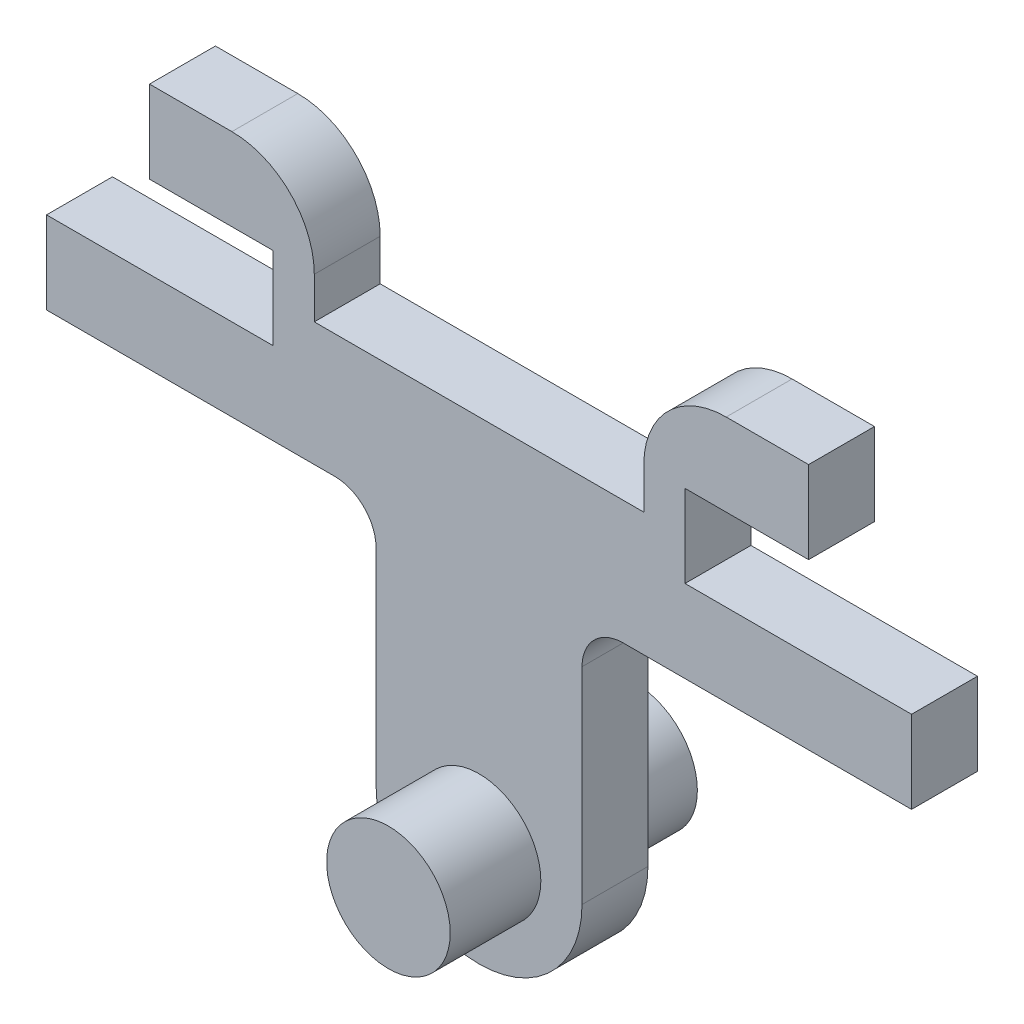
ISO-10303-21;
HEADER;
FILE_DESCRIPTION(('STEP AP214'),'2;1');
FILE_NAME('part.step','',(''),(''),'','','');
FILE_SCHEMA(('AUTOMOTIVE_DESIGN { 1 0 10303 214 1 1 1 1 }'));
ENDSEC;
DATA;
#1=APPLICATION_CONTEXT('core data for automotive mechanical design processes');
#2=APPLICATION_PROTOCOL_DEFINITION('international standard','automotive_design',2000,#1);
#3=PRODUCT_CONTEXT('',#1,'mechanical');
#4=PRODUCT('Part','Part','',(#3));
#5=PRODUCT_RELATED_PRODUCT_CATEGORY('part','',(#4));
#6=PRODUCT_DEFINITION_FORMATION('','',#4);
#7=PRODUCT_DEFINITION_CONTEXT('part definition',#1,'design');
#8=PRODUCT_DEFINITION('design','',#6,#7);
#9=PRODUCT_DEFINITION_SHAPE('','',#8);
#10=(LENGTH_UNIT() NAMED_UNIT(*) SI_UNIT(.MILLI.,.METRE.));
#11=(NAMED_UNIT(*) PLANE_ANGLE_UNIT() SI_UNIT($,.RADIAN.));
#12=(NAMED_UNIT(*) SI_UNIT($,.STERADIAN.) SOLID_ANGLE_UNIT());
#13=UNCERTAINTY_MEASURE_WITH_UNIT(LENGTH_MEASURE(1.E-05),#10,'distance_accuracy_value','');
#14=(GEOMETRIC_REPRESENTATION_CONTEXT(3) GLOBAL_UNCERTAINTY_ASSIGNED_CONTEXT((#13)) GLOBAL_UNIT_ASSIGNED_CONTEXT((#10,
#11,#12)) REPRESENTATION_CONTEXT('',''));
#15=CARTESIAN_POINT('',(0.,0.,0.));
#16=DIRECTION('',(0.,0.,1.));
#17=DIRECTION('',(1.,0.,0.));
#18=AXIS2_PLACEMENT_3D('',#15,#16,#17);
#19=CARTESIAN_POINT('',(0.,0.,-15.));
#20=DIRECTION('',(0.,0.,1.));
#21=DIRECTION('',(1.,0.,0.));
#22=AXIS2_PLACEMENT_3D('',#19,#20,#21);
#23=CYLINDRICAL_SURFACE('',#22,7.5);
#24=CARTESIAN_POINT('',(0.,0.,4.));
#25=DIRECTION('',(0.,0.,1.));
#26=DIRECTION('',(1.,0.,0.));
#27=AXIS2_PLACEMENT_3D('',#24,#25,#26);
#28=CIRCLE('',#27,7.5);
#29=CARTESIAN_POINT('',(7.5,0.,4.));
#30=VERTEX_POINT('',#29);
#31=EDGE_CURVE('E11',#30,#30,#28,.F.);
#32=ORIENTED_EDGE('',*,*,#31,.F.);
#33=EDGE_LOOP('',(#32));
#34=FACE_BOUND('',#33,.T.);
#35=CARTESIAN_POINT('',(0.,0.,15.));
#36=DIRECTION('',(0.,0.,1.));
#37=DIRECTION('',(1.,0.,0.));
#38=AXIS2_PLACEMENT_3D('',#35,#36,#37);
#39=CIRCLE('',#38,7.5);
#40=CARTESIAN_POINT('',(7.5,0.,15.));
#41=VERTEX_POINT('',#40);
#42=EDGE_CURVE('E389',#41,#41,#39,.T.);
#43=ORIENTED_EDGE('',*,*,#42,.F.);
#44=EDGE_LOOP('',(#43));
#45=FACE_BOUND('',#44,.T.);
#46=ADVANCED_FACE('F33',(#34,#45),#23,.T.);
#47=CARTESIAN_POINT('',(0.,0.,15.));
#48=DIRECTION('',(0.,0.,1.));
#49=DIRECTION('',(1.,0.,0.));
#50=AXIS2_PLACEMENT_3D('',#47,#48,#49);
#51=PLANE('',#50);
#52=ORIENTED_EDGE('',*,*,#42,.T.);
#53=EDGE_LOOP('',(#52));
#54=FACE_BOUND('',#53,.T.);
#55=ADVANCED_FACE('F410',(#54),#51,.T.);
#56=CARTESIAN_POINT('',(-30.,50.,4.));
#57=DIRECTION('',(0.,0.,-1.));
#58=DIRECTION('',(-1.,0.,0.));
#59=AXIS2_PLACEMENT_3D('',#56,#57,#58);
#60=CYLINDRICAL_SURFACE('',#59,10.);
#61=CARTESIAN_POINT('',(-30.,50.,-4.));
#62=DIRECTION('',(0.,0.,-1.));
#63=DIRECTION('',(1.,0.,0.));
#64=AXIS2_PLACEMENT_3D('',#61,#62,#63);
#65=CIRCLE('',#64,10.);
#66=CARTESIAN_POINT('',(-30.,60.,-4.));
#67=VERTEX_POINT('',#66);
#68=CARTESIAN_POINT('',(-20.,50.,-4.));
#69=VERTEX_POINT('',#68);
#70=EDGE_CURVE('E196',#67,#69,#65,.T.);
#71=ORIENTED_EDGE('',*,*,#70,.F.);
#72=DIRECTION('',(0.,0.,-1.));
#73=VECTOR('',#72,1.);
#74=CARTESIAN_POINT('',(-30.,60.,4.));
#75=LINE('',#74,#73);
#76=CARTESIAN_POINT('',(-30.,60.,4.));
#77=VERTEX_POINT('',#76);
#78=EDGE_CURVE('E47',#77,#67,#75,.T.);
#79=ORIENTED_EDGE('',*,*,#78,.F.);
#80=CARTESIAN_POINT('',(-30.,50.,4.));
#81=DIRECTION('',(0.,0.,-1.));
#82=DIRECTION('',(1.,0.,0.));
#83=AXIS2_PLACEMENT_3D('',#80,#81,#82);
#84=CIRCLE('',#83,10.);
#85=CARTESIAN_POINT('',(-20.,50.,4.));
#86=VERTEX_POINT('',#85);
#87=EDGE_CURVE('E198',#77,#86,#84,.T.);
#88=ORIENTED_EDGE('',*,*,#87,.T.);
#89=DIRECTION('',(0.,0.,-1.));
#90=VECTOR('',#89,1.);
#91=CARTESIAN_POINT('',(-20.,50.,4.));
#92=LINE('',#91,#90);
#93=EDGE_CURVE('E192',#86,#69,#92,.T.);
#94=ORIENTED_EDGE('',*,*,#93,.T.);
#95=EDGE_LOOP('',(#71,#79,#88,#94));
#96=FACE_BOUND('',#95,.T.);
#97=ADVANCED_FACE('F194',(#96),#60,.T.);
#98=CARTESIAN_POINT('',(-40.,60.,4.));
#99=DIRECTION('',(0.,1.,0.));
#100=DIRECTION('',(-1.,0.,0.));
#101=AXIS2_PLACEMENT_3D('',#98,#99,#100);
#102=PLANE('',#101);
#103=DIRECTION('',(1.,0.,0.));
#104=VECTOR('',#103,1.);
#105=CARTESIAN_POINT('',(-40.,60.,-4.));
#106=LINE('',#105,#104);
#107=CARTESIAN_POINT('',(-40.,60.,-4.));
#108=VERTEX_POINT('',#107);
#109=EDGE_CURVE('E215',#108,#67,#106,.T.);
#110=ORIENTED_EDGE('',*,*,#109,.F.);
#111=DIRECTION('',(0.,0.,-1.));
#112=VECTOR('',#111,1.);
#113=CARTESIAN_POINT('',(-40.,60.,4.));
#114=LINE('',#113,#112);
#115=CARTESIAN_POINT('',(-40.,60.,4.));
#116=VERTEX_POINT('',#115);
#117=EDGE_CURVE('E55',#116,#108,#114,.T.);
#118=ORIENTED_EDGE('',*,*,#117,.F.);
#119=DIRECTION('',(1.,0.,0.));
#120=VECTOR('',#119,1.);
#121=CARTESIAN_POINT('',(-40.,60.,4.));
#122=LINE('',#121,#120);
#123=EDGE_CURVE('E203',#116,#77,#122,.T.);
#124=ORIENTED_EDGE('',*,*,#123,.T.);
#125=ORIENTED_EDGE('',*,*,#78,.T.);
#126=EDGE_LOOP('',(#110,#118,#124,#125));
#127=FACE_BOUND('',#126,.T.);
#128=ADVANCED_FACE('F447',(#127),#102,.T.);
#129=CARTESIAN_POINT('',(-40.,50.,4.));
#130=DIRECTION('',(-1.,0.,0.));
#131=DIRECTION('',(0.,0.,1.));
#132=AXIS2_PLACEMENT_3D('',#129,#130,#131);
#133=PLANE('',#132);
#134=DIRECTION('',(0.,1.,0.));
#135=VECTOR('',#134,1.);
#136=CARTESIAN_POINT('',(-40.,50.,-4.));
#137=LINE('',#136,#135);
#138=CARTESIAN_POINT('',(-40.,50.,-4.));
#139=VERTEX_POINT('',#138);
#140=EDGE_CURVE('E276',#139,#108,#137,.T.);
#141=ORIENTED_EDGE('',*,*,#140,.F.);
#142=DIRECTION('',(0.,0.,-1.));
#143=VECTOR('',#142,1.);
#144=CARTESIAN_POINT('',(-40.,50.,4.));
#145=LINE('',#144,#143);
#146=CARTESIAN_POINT('',(-40.,50.,4.));
#147=VERTEX_POINT('',#146);
#148=EDGE_CURVE('E348',#147,#139,#145,.T.);
#149=ORIENTED_EDGE('',*,*,#148,.F.);
#150=DIRECTION('',(0.,1.,0.));
#151=VECTOR('',#150,1.);
#152=CARTESIAN_POINT('',(-40.,50.,4.));
#153=LINE('',#152,#151);
#154=EDGE_CURVE('E342',#147,#116,#153,.T.);
#155=ORIENTED_EDGE('',*,*,#154,.T.);
#156=ORIENTED_EDGE('',*,*,#117,.T.);
#157=EDGE_LOOP('',(#141,#149,#155,#156));
#158=FACE_BOUND('',#157,.T.);
#159=ADVANCED_FACE('F456',(#158),#133,.T.);
#160=CARTESIAN_POINT('',(-25.,50.,4.));
#161=DIRECTION('',(0.,-1.,0.));
#162=DIRECTION('',(1.,0.,0.));
#163=AXIS2_PLACEMENT_3D('',#160,#161,#162);
#164=PLANE('',#163);
#165=DIRECTION('',(-1.,0.,0.));
#166=VECTOR('',#165,1.);
#167=CARTESIAN_POINT('',(-25.,50.,-4.));
#168=LINE('',#167,#166);
#169=CARTESIAN_POINT('',(-25.,50.,-4.));
#170=VERTEX_POINT('',#169);
#171=EDGE_CURVE('E273',#170,#139,#168,.T.);
#172=ORIENTED_EDGE('',*,*,#171,.F.);
#173=DIRECTION('',(0.,0.,-1.));
#174=VECTOR('',#173,1.);
#175=CARTESIAN_POINT('',(-25.,50.,4.));
#176=LINE('',#175,#174);
#177=CARTESIAN_POINT('',(-25.,50.,4.));
#178=VERTEX_POINT('',#177);
#179=EDGE_CURVE('E350',#178,#170,#176,.T.);
#180=ORIENTED_EDGE('',*,*,#179,.F.);
#181=DIRECTION('',(-1.,0.,0.));
#182=VECTOR('',#181,1.);
#183=CARTESIAN_POINT('',(-25.,50.,4.));
#184=LINE('',#183,#182);
#185=EDGE_CURVE('E339',#178,#147,#184,.T.);
#186=ORIENTED_EDGE('',*,*,#185,.T.);
#187=ORIENTED_EDGE('',*,*,#148,.T.);
#188=EDGE_LOOP('',(#172,#180,#186,#187));
#189=FACE_BOUND('',#188,.T.);
#190=ADVANCED_FACE('F465',(#189),#164,.T.);
#191=CARTESIAN_POINT('',(-25.,40.,4.));
#192=DIRECTION('',(-1.,0.,0.));
#193=DIRECTION('',(0.,0.,1.));
#194=AXIS2_PLACEMENT_3D('',#191,#192,#193);
#195=PLANE('',#194);
#196=DIRECTION('',(0.,1.,0.));
#197=VECTOR('',#196,1.);
#198=CARTESIAN_POINT('',(-25.,40.,-4.));
#199=LINE('',#198,#197);
#200=CARTESIAN_POINT('',(-25.,40.,-4.));
#201=VERTEX_POINT('',#200);
#202=EDGE_CURVE('E270',#201,#170,#199,.T.);
#203=ORIENTED_EDGE('',*,*,#202,.F.);
#204=DIRECTION('',(0.,0.,-1.));
#205=VECTOR('',#204,1.);
#206=CARTESIAN_POINT('',(-25.,40.,4.));
#207=LINE('',#206,#205);
#208=CARTESIAN_POINT('',(-25.,40.,4.));
#209=VERTEX_POINT('',#208);
#210=EDGE_CURVE('E352',#209,#201,#207,.T.);
#211=ORIENTED_EDGE('',*,*,#210,.F.);
#212=DIRECTION('',(0.,1.,0.));
#213=VECTOR('',#212,1.);
#214=CARTESIAN_POINT('',(-25.,40.,4.));
#215=LINE('',#214,#213);
#216=EDGE_CURVE('E336',#209,#178,#215,.T.);
#217=ORIENTED_EDGE('',*,*,#216,.T.);
#218=ORIENTED_EDGE('',*,*,#179,.T.);
#219=EDGE_LOOP('',(#203,#211,#217,#218));
#220=FACE_BOUND('',#219,.T.);
#221=ADVANCED_FACE('F475',(#220),#195,.T.);
#222=CARTESIAN_POINT('',(-52.5,40.,4.));
#223=DIRECTION('',(0.,1.,0.));
#224=DIRECTION('',(0.,0.,1.));
#225=AXIS2_PLACEMENT_3D('',#222,#223,#224);
#226=PLANE('',#225);
#227=DIRECTION('',(1.,0.,0.));
#228=VECTOR('',#227,1.);
#229=CARTESIAN_POINT('',(-52.5,40.,-4.));
#230=LINE('',#229,#228);
#231=CARTESIAN_POINT('',(-52.5,40.,-4.));
#232=VERTEX_POINT('',#231);
#233=EDGE_CURVE('E267',#232,#201,#230,.T.);
#234=ORIENTED_EDGE('',*,*,#233,.F.);
#235=DIRECTION('',(0.,0.,-1.));
#236=VECTOR('',#235,1.);
#237=CARTESIAN_POINT('',(-52.5,40.,4.));
#238=LINE('',#237,#236);
#239=CARTESIAN_POINT('',(-52.5,40.,4.));
#240=VERTEX_POINT('',#239);
#241=EDGE_CURVE('E354',#240,#232,#238,.T.);
#242=ORIENTED_EDGE('',*,*,#241,.F.);
#243=DIRECTION('',(1.,0.,0.));
#244=VECTOR('',#243,1.);
#245=CARTESIAN_POINT('',(-52.5,40.,4.));
#246=LINE('',#245,#244);
#247=EDGE_CURVE('E333',#240,#209,#246,.T.);
#248=ORIENTED_EDGE('',*,*,#247,.T.);
#249=ORIENTED_EDGE('',*,*,#210,.T.);
#250=EDGE_LOOP('',(#234,#242,#248,#249));
#251=FACE_BOUND('',#250,.T.);
#252=ADVANCED_FACE('F485',(#251),#226,.T.);
#253=CARTESIAN_POINT('',(-52.5,30.,4.));
#254=DIRECTION('',(-1.,0.,0.));
#255=DIRECTION('',(0.,-1.,0.));
#256=AXIS2_PLACEMENT_3D('',#253,#254,#255);
#257=PLANE('',#256);
#258=DIRECTION('',(0.,1.,0.));
#259=VECTOR('',#258,1.);
#260=CARTESIAN_POINT('',(-52.5,30.,-4.));
#261=LINE('',#260,#259);
#262=CARTESIAN_POINT('',(-52.5,30.,-4.));
#263=VERTEX_POINT('',#262);
#264=EDGE_CURVE('E264',#263,#232,#261,.T.);
#265=ORIENTED_EDGE('',*,*,#264,.F.);
#266=DIRECTION('',(0.,0.,-1.));
#267=VECTOR('',#266,1.);
#268=CARTESIAN_POINT('',(-52.5,30.,4.));
#269=LINE('',#268,#267);
#270=CARTESIAN_POINT('',(-52.5,30.,4.));
#271=VERTEX_POINT('',#270);
#272=EDGE_CURVE('E356',#271,#263,#269,.T.);
#273=ORIENTED_EDGE('',*,*,#272,.F.);
#274=DIRECTION('',(0.,1.,0.));
#275=VECTOR('',#274,1.);
#276=CARTESIAN_POINT('',(-52.5,30.,4.));
#277=LINE('',#276,#275);
#278=EDGE_CURVE('E330',#271,#240,#277,.T.);
#279=ORIENTED_EDGE('',*,*,#278,.T.);
#280=ORIENTED_EDGE('',*,*,#241,.T.);
#281=EDGE_LOOP('',(#265,#273,#279,#280));
#282=FACE_BOUND('',#281,.T.);
#283=ADVANCED_FACE('F495',(#282),#257,.T.);
#284=CARTESIAN_POINT('',(-17.5,30.,4.));
#285=DIRECTION('',(0.,-1.,0.));
#286=DIRECTION('',(0.,0.,-1.));
#287=AXIS2_PLACEMENT_3D('',#284,#285,#286);
#288=PLANE('',#287);
#289=DIRECTION('',(-1.,0.,0.));
#290=VECTOR('',#289,1.);
#291=CARTESIAN_POINT('',(-17.5,30.,-4.));
#292=LINE('',#291,#290);
#293=CARTESIAN_POINT('',(-17.5,30.,-4.));
#294=VERTEX_POINT('',#293);
#295=EDGE_CURVE('E261',#294,#263,#292,.T.);
#296=ORIENTED_EDGE('',*,*,#295,.F.);
#297=DIRECTION('',(0.,0.,-1.));
#298=VECTOR('',#297,1.);
#299=CARTESIAN_POINT('',(-17.5,30.,4.));
#300=LINE('',#299,#298);
#301=CARTESIAN_POINT('',(-17.5,30.,4.));
#302=VERTEX_POINT('',#301);
#303=EDGE_CURVE('E358',#302,#294,#300,.T.);
#304=ORIENTED_EDGE('',*,*,#303,.F.);
#305=DIRECTION('',(-1.,0.,0.));
#306=VECTOR('',#305,1.);
#307=CARTESIAN_POINT('',(-17.5,30.,4.));
#308=LINE('',#307,#306);
#309=EDGE_CURVE('E327',#302,#271,#308,.T.);
#310=ORIENTED_EDGE('',*,*,#309,.T.);
#311=ORIENTED_EDGE('',*,*,#272,.T.);
#312=EDGE_LOOP('',(#296,#304,#310,#311));
#313=FACE_BOUND('',#312,.T.);
#314=ADVANCED_FACE('F505',(#313),#288,.T.);
#315=CARTESIAN_POINT('',(-17.5,25.,4.));
#316=DIRECTION('',(0.,0.,-1.));
#317=DIRECTION('',(-1.,0.,0.));
#318=AXIS2_PLACEMENT_3D('',#315,#316,#317);
#319=CYLINDRICAL_SURFACE('',#318,5.);
#320=CARTESIAN_POINT('',(-17.5,25.,-4.));
#321=DIRECTION('',(0.,0.,1.));
#322=DIRECTION('',(-1.,0.,0.));
#323=AXIS2_PLACEMENT_3D('',#320,#321,#322);
#324=CIRCLE('',#323,5.);
#325=CARTESIAN_POINT('',(-12.5,25.,-4.));
#326=VERTEX_POINT('',#325);
#327=EDGE_CURVE('E258',#326,#294,#324,.T.);
#328=ORIENTED_EDGE('',*,*,#327,.F.);
#329=DIRECTION('',(0.,0.,-1.));
#330=VECTOR('',#329,1.);
#331=CARTESIAN_POINT('',(-12.5,25.,4.));
#332=LINE('',#331,#330);
#333=CARTESIAN_POINT('',(-12.5,25.,4.));
#334=VERTEX_POINT('',#333);
#335=EDGE_CURVE('E360',#334,#326,#332,.T.);
#336=ORIENTED_EDGE('',*,*,#335,.F.);
#337=CARTESIAN_POINT('',(-17.5,25.,4.));
#338=DIRECTION('',(0.,0.,1.));
#339=DIRECTION('',(-1.,0.,0.));
#340=AXIS2_PLACEMENT_3D('',#337,#338,#339);
#341=CIRCLE('',#340,5.);
#342=EDGE_CURVE('E324',#334,#302,#341,.T.);
#343=ORIENTED_EDGE('',*,*,#342,.T.);
#344=ORIENTED_EDGE('',*,*,#303,.T.);
#345=EDGE_LOOP('',(#328,#336,#343,#344));
#346=FACE_BOUND('',#345,.T.);
#347=ADVANCED_FACE('F515',(#346),#319,.F.);
#348=CARTESIAN_POINT('',(-12.5,0.,4.));
#349=DIRECTION('',(-1.,0.,0.));
#350=DIRECTION('',(0.,0.,1.));
#351=AXIS2_PLACEMENT_3D('',#348,#349,#350);
#352=PLANE('',#351);
#353=DIRECTION('',(0.,1.,0.));
#354=VECTOR('',#353,1.);
#355=CARTESIAN_POINT('',(-12.5,0.,-4.));
#356=LINE('',#355,#354);
#357=CARTESIAN_POINT('',(-12.5,0.,-4.));
#358=VERTEX_POINT('',#357);
#359=EDGE_CURVE('E255',#358,#326,#356,.T.);
#360=ORIENTED_EDGE('',*,*,#359,.F.);
#361=DIRECTION('',(0.,0.,-1.));
#362=VECTOR('',#361,1.);
#363=CARTESIAN_POINT('',(-12.5,0.,4.));
#364=LINE('',#363,#362);
#365=CARTESIAN_POINT('',(-12.5,0.,4.));
#366=VERTEX_POINT('',#365);
#367=EDGE_CURVE('E362',#366,#358,#364,.T.);
#368=ORIENTED_EDGE('',*,*,#367,.F.);
#369=DIRECTION('',(0.,1.,0.));
#370=VECTOR('',#369,1.);
#371=CARTESIAN_POINT('',(-12.5,0.,4.));
#372=LINE('',#371,#370);
#373=EDGE_CURVE('E321',#366,#334,#372,.T.);
#374=ORIENTED_EDGE('',*,*,#373,.T.);
#375=ORIENTED_EDGE('',*,*,#335,.T.);
#376=EDGE_LOOP('',(#360,#368,#374,#375));
#377=FACE_BOUND('',#376,.T.);
#378=ADVANCED_FACE('F525',(#377),#352,.T.);
#379=CARTESIAN_POINT('',(0.,0.,4.));
#380=DIRECTION('',(0.,0.,-1.));
#381=DIRECTION('',(-1.,0.,0.));
#382=AXIS2_PLACEMENT_3D('',#379,#380,#381);
#383=CYLINDRICAL_SURFACE('',#382,12.5);
#384=CARTESIAN_POINT('',(0.,0.,-4.));
#385=DIRECTION('',(0.,0.,-1.));
#386=DIRECTION('',(-1.,0.,0.));
#387=AXIS2_PLACEMENT_3D('',#384,#385,#386);
#388=CIRCLE('',#387,12.5);
#389=CARTESIAN_POINT('',(12.5,0.,-4.));
#390=VERTEX_POINT('',#389);
#391=EDGE_CURVE('E252',#390,#358,#388,.T.);
#392=ORIENTED_EDGE('',*,*,#391,.F.);
#393=DIRECTION('',(0.,0.,-1.));
#394=VECTOR('',#393,1.);
#395=CARTESIAN_POINT('',(12.5,0.,4.));
#396=LINE('',#395,#394);
#397=CARTESIAN_POINT('',(12.5,0.,4.));
#398=VERTEX_POINT('',#397);
#399=EDGE_CURVE('E364',#398,#390,#396,.T.);
#400=ORIENTED_EDGE('',*,*,#399,.F.);
#401=CARTESIAN_POINT('',(0.,0.,4.));
#402=DIRECTION('',(0.,0.,-1.));
#403=DIRECTION('',(-1.,0.,0.));
#404=AXIS2_PLACEMENT_3D('',#401,#402,#403);
#405=CIRCLE('',#404,12.5);
#406=EDGE_CURVE('E318',#398,#366,#405,.T.);
#407=ORIENTED_EDGE('',*,*,#406,.T.);
#408=ORIENTED_EDGE('',*,*,#367,.T.);
#409=EDGE_LOOP('',(#392,#400,#407,#408));
#410=FACE_BOUND('',#409,.T.);
#411=ADVANCED_FACE('F535',(#410),#383,.T.);
#412=CARTESIAN_POINT('',(12.5,0.,4.));
#413=DIRECTION('',(1.,0.,0.));
#414=DIRECTION('',(0.,0.,-1.));
#415=AXIS2_PLACEMENT_3D('',#412,#413,#414);
#416=PLANE('',#415);
#417=DIRECTION('',(0.,-1.,0.));
#418=VECTOR('',#417,1.);
#419=CARTESIAN_POINT('',(12.5,0.,-4.));
#420=LINE('',#419,#418);
#421=CARTESIAN_POINT('',(12.5,25.,-4.));
#422=VERTEX_POINT('',#421);
#423=EDGE_CURVE('E249',#422,#390,#420,.T.);
#424=ORIENTED_EDGE('',*,*,#423,.F.);
#425=DIRECTION('',(0.,0.,-1.));
#426=VECTOR('',#425,1.);
#427=CARTESIAN_POINT('',(12.5,25.,4.));
#428=LINE('',#427,#426);
#429=CARTESIAN_POINT('',(12.5,25.,4.));
#430=VERTEX_POINT('',#429);
#431=EDGE_CURVE('E366',#430,#422,#428,.T.);
#432=ORIENTED_EDGE('',*,*,#431,.F.);
#433=DIRECTION('',(0.,-1.,0.));
#434=VECTOR('',#433,1.);
#435=CARTESIAN_POINT('',(12.5,0.,4.));
#436=LINE('',#435,#434);
#437=EDGE_CURVE('E315',#430,#398,#436,.T.);
#438=ORIENTED_EDGE('',*,*,#437,.T.);
#439=ORIENTED_EDGE('',*,*,#399,.T.);
#440=EDGE_LOOP('',(#424,#432,#438,#439));
#441=FACE_BOUND('',#440,.T.);
#442=ADVANCED_FACE('F545',(#441),#416,.T.);
#443=CARTESIAN_POINT('',(17.5,25.,4.));
#444=DIRECTION('',(0.,0.,-1.));
#445=DIRECTION('',(-1.,0.,0.));
#446=AXIS2_PLACEMENT_3D('',#443,#444,#445);
#447=CYLINDRICAL_SURFACE('',#446,5.);
#448=CARTESIAN_POINT('',(17.5,25.,-4.));
#449=DIRECTION('',(0.,0.,1.));
#450=DIRECTION('',(-1.,0.,0.));
#451=AXIS2_PLACEMENT_3D('',#448,#449,#450);
#452=CIRCLE('',#451,5.);
#453=CARTESIAN_POINT('',(17.5,30.,-4.));
#454=VERTEX_POINT('',#453);
#455=EDGE_CURVE('E246',#454,#422,#452,.T.);
#456=ORIENTED_EDGE('',*,*,#455,.F.);
#457=DIRECTION('',(0.,0.,-1.));
#458=VECTOR('',#457,1.);
#459=CARTESIAN_POINT('',(17.5,30.,4.));
#460=LINE('',#459,#458);
#461=CARTESIAN_POINT('',(17.5,30.,4.));
#462=VERTEX_POINT('',#461);
#463=EDGE_CURVE('E368',#462,#454,#460,.T.);
#464=ORIENTED_EDGE('',*,*,#463,.F.);
#465=CARTESIAN_POINT('',(17.5,25.,4.));
#466=DIRECTION('',(0.,0.,1.));
#467=DIRECTION('',(-1.,0.,0.));
#468=AXIS2_PLACEMENT_3D('',#465,#466,#467);
#469=CIRCLE('',#468,5.);
#470=EDGE_CURVE('E312',#462,#430,#469,.T.);
#471=ORIENTED_EDGE('',*,*,#470,.T.);
#472=ORIENTED_EDGE('',*,*,#431,.T.);
#473=EDGE_LOOP('',(#456,#464,#471,#472));
#474=FACE_BOUND('',#473,.T.);
#475=ADVANCED_FACE('F555',(#474),#447,.F.);
#476=CARTESIAN_POINT('',(17.5,30.,4.));
#477=DIRECTION('',(0.,-1.,0.));
#478=DIRECTION('',(0.,0.,-1.));
#479=AXIS2_PLACEMENT_3D('',#476,#477,#478);
#480=PLANE('',#479);
#481=DIRECTION('',(-1.,0.,0.));
#482=VECTOR('',#481,1.);
#483=CARTESIAN_POINT('',(17.5,30.,-4.));
#484=LINE('',#483,#482);
#485=CARTESIAN_POINT('',(52.5,30.,-4.));
#486=VERTEX_POINT('',#485);
#487=EDGE_CURVE('E243',#486,#454,#484,.T.);
#488=ORIENTED_EDGE('',*,*,#487,.F.);
#489=DIRECTION('',(0.,0.,-1.));
#490=VECTOR('',#489,1.);
#491=CARTESIAN_POINT('',(52.5,30.,4.));
#492=LINE('',#491,#490);
#493=CARTESIAN_POINT('',(52.5,30.,4.));
#494=VERTEX_POINT('',#493);
#495=EDGE_CURVE('E370',#494,#486,#492,.T.);
#496=ORIENTED_EDGE('',*,*,#495,.F.);
#497=DIRECTION('',(-1.,0.,0.));
#498=VECTOR('',#497,1.);
#499=CARTESIAN_POINT('',(17.5,30.,4.));
#500=LINE('',#499,#498);
#501=EDGE_CURVE('E309',#494,#462,#500,.T.);
#502=ORIENTED_EDGE('',*,*,#501,.T.);
#503=ORIENTED_EDGE('',*,*,#463,.T.);
#504=EDGE_LOOP('',(#488,#496,#502,#503));
#505=FACE_BOUND('',#504,.T.);
#506=ADVANCED_FACE('F565',(#505),#480,.T.);
#507=CARTESIAN_POINT('',(52.5,30.,4.));
#508=DIRECTION('',(1.,0.,0.));
#509=DIRECTION('',(0.,1.,0.));
#510=AXIS2_PLACEMENT_3D('',#507,#508,#509);
#511=PLANE('',#510);
#512=DIRECTION('',(0.,-1.,0.));
#513=VECTOR('',#512,1.);
#514=CARTESIAN_POINT('',(52.5,30.,-4.));
#515=LINE('',#514,#513);
#516=CARTESIAN_POINT('',(52.5,40.,-4.));
#517=VERTEX_POINT('',#516);
#518=EDGE_CURVE('E240',#517,#486,#515,.T.);
#519=ORIENTED_EDGE('',*,*,#518,.F.);
#520=DIRECTION('',(0.,0.,-1.));
#521=VECTOR('',#520,1.);
#522=CARTESIAN_POINT('',(52.5,40.,4.));
#523=LINE('',#522,#521);
#524=CARTESIAN_POINT('',(52.5,40.,4.));
#525=VERTEX_POINT('',#524);
#526=EDGE_CURVE('E372',#525,#517,#523,.T.);
#527=ORIENTED_EDGE('',*,*,#526,.F.);
#528=DIRECTION('',(0.,-1.,0.));
#529=VECTOR('',#528,1.);
#530=CARTESIAN_POINT('',(52.5,30.,4.));
#531=LINE('',#530,#529);
#532=EDGE_CURVE('E306',#525,#494,#531,.T.);
#533=ORIENTED_EDGE('',*,*,#532,.T.);
#534=ORIENTED_EDGE('',*,*,#495,.T.);
#535=EDGE_LOOP('',(#519,#527,#533,#534));
#536=FACE_BOUND('',#535,.T.);
#537=ADVANCED_FACE('F575',(#536),#511,.T.);
#538=CARTESIAN_POINT('',(52.5,40.,4.));
#539=DIRECTION('',(0.,1.,0.));
#540=DIRECTION('',(-1.,0.,0.));
#541=AXIS2_PLACEMENT_3D('',#538,#539,#540);
#542=PLANE('',#541);
#543=DIRECTION('',(1.,0.,0.));
#544=VECTOR('',#543,1.);
#545=CARTESIAN_POINT('',(52.5,40.,-4.));
#546=LINE('',#545,#544);
#547=CARTESIAN_POINT('',(25.,40.,-4.));
#548=VERTEX_POINT('',#547);
#549=EDGE_CURVE('E237',#548,#517,#546,.T.);
#550=ORIENTED_EDGE('',*,*,#549,.F.);
#551=DIRECTION('',(0.,0.,-1.));
#552=VECTOR('',#551,1.);
#553=CARTESIAN_POINT('',(25.,40.,4.));
#554=LINE('',#553,#552);
#555=CARTESIAN_POINT('',(25.,40.,4.));
#556=VERTEX_POINT('',#555);
#557=EDGE_CURVE('E374',#556,#548,#554,.T.);
#558=ORIENTED_EDGE('',*,*,#557,.F.);
#559=DIRECTION('',(1.,0.,0.));
#560=VECTOR('',#559,1.);
#561=CARTESIAN_POINT('',(52.5,40.,4.));
#562=LINE('',#561,#560);
#563=EDGE_CURVE('E303',#556,#525,#562,.T.);
#564=ORIENTED_EDGE('',*,*,#563,.T.);
#565=ORIENTED_EDGE('',*,*,#526,.T.);
#566=EDGE_LOOP('',(#550,#558,#564,#565));
#567=FACE_BOUND('',#566,.T.);
#568=ADVANCED_FACE('F585',(#567),#542,.T.);
#569=CARTESIAN_POINT('',(25.,40.,4.));
#570=DIRECTION('',(1.,0.,0.));
#571=DIRECTION('',(0.,0.,-1.));
#572=AXIS2_PLACEMENT_3D('',#569,#570,#571);
#573=PLANE('',#572);
#574=DIRECTION('',(0.,-1.,0.));
#575=VECTOR('',#574,1.);
#576=CARTESIAN_POINT('',(25.,40.,-4.));
#577=LINE('',#576,#575);
#578=CARTESIAN_POINT('',(25.,50.,-4.));
#579=VERTEX_POINT('',#578);
#580=EDGE_CURVE('E234',#579,#548,#577,.T.);
#581=ORIENTED_EDGE('',*,*,#580,.F.);
#582=DIRECTION('',(0.,0.,-1.));
#583=VECTOR('',#582,1.);
#584=CARTESIAN_POINT('',(25.,50.,4.));
#585=LINE('',#584,#583);
#586=CARTESIAN_POINT('',(25.,50.,4.));
#587=VERTEX_POINT('',#586);
#588=EDGE_CURVE('E376',#587,#579,#585,.T.);
#589=ORIENTED_EDGE('',*,*,#588,.F.);
#590=DIRECTION('',(0.,-1.,0.));
#591=VECTOR('',#590,1.);
#592=CARTESIAN_POINT('',(25.,40.,4.));
#593=LINE('',#592,#591);
#594=EDGE_CURVE('E300',#587,#556,#593,.T.);
#595=ORIENTED_EDGE('',*,*,#594,.T.);
#596=ORIENTED_EDGE('',*,*,#557,.T.);
#597=EDGE_LOOP('',(#581,#589,#595,#596));
#598=FACE_BOUND('',#597,.T.);
#599=ADVANCED_FACE('F595',(#598),#573,.T.);
#600=CARTESIAN_POINT('',(25.,50.,4.));
#601=DIRECTION('',(0.,-1.,0.));
#602=DIRECTION('',(1.,0.,0.));
#603=AXIS2_PLACEMENT_3D('',#600,#601,#602);
#604=PLANE('',#603);
#605=DIRECTION('',(-1.,0.,0.));
#606=VECTOR('',#605,1.);
#607=CARTESIAN_POINT('',(25.,50.,-4.));
#608=LINE('',#607,#606);
#609=CARTESIAN_POINT('',(40.,50.,-4.));
#610=VERTEX_POINT('',#609);
#611=EDGE_CURVE('E231',#610,#579,#608,.T.);
#612=ORIENTED_EDGE('',*,*,#611,.F.);
#613=DIRECTION('',(0.,0.,-1.));
#614=VECTOR('',#613,1.);
#615=CARTESIAN_POINT('',(40.,50.,4.));
#616=LINE('',#615,#614);
#617=CARTESIAN_POINT('',(40.,50.,4.));
#618=VERTEX_POINT('',#617);
#619=EDGE_CURVE('E378',#618,#610,#616,.T.);
#620=ORIENTED_EDGE('',*,*,#619,.F.);
#621=DIRECTION('',(-1.,0.,0.));
#622=VECTOR('',#621,1.);
#623=CARTESIAN_POINT('',(25.,50.,4.));
#624=LINE('',#623,#622);
#625=EDGE_CURVE('E297',#618,#587,#624,.T.);
#626=ORIENTED_EDGE('',*,*,#625,.T.);
#627=ORIENTED_EDGE('',*,*,#588,.T.);
#628=EDGE_LOOP('',(#612,#620,#626,#627));
#629=FACE_BOUND('',#628,.T.);
#630=ADVANCED_FACE('F605',(#629),#604,.T.);
#631=CARTESIAN_POINT('',(40.,50.,4.));
#632=DIRECTION('',(1.,0.,0.));
#633=DIRECTION('',(0.,0.,-1.));
#634=AXIS2_PLACEMENT_3D('',#631,#632,#633);
#635=PLANE('',#634);
#636=DIRECTION('',(0.,-1.,0.));
#637=VECTOR('',#636,1.);
#638=CARTESIAN_POINT('',(40.,50.,-4.));
#639=LINE('',#638,#637);
#640=CARTESIAN_POINT('',(40.,60.,-4.));
#641=VERTEX_POINT('',#640);
#642=EDGE_CURVE('E228',#641,#610,#639,.T.);
#643=ORIENTED_EDGE('',*,*,#642,.F.);
#644=DIRECTION('',(0.,0.,-1.));
#645=VECTOR('',#644,1.);
#646=CARTESIAN_POINT('',(40.,60.,4.));
#647=LINE('',#646,#645);
#648=CARTESIAN_POINT('',(40.,60.,4.));
#649=VERTEX_POINT('',#648);
#650=EDGE_CURVE('E380',#649,#641,#647,.T.);
#651=ORIENTED_EDGE('',*,*,#650,.F.);
#652=DIRECTION('',(0.,-1.,0.));
#653=VECTOR('',#652,1.);
#654=CARTESIAN_POINT('',(40.,50.,4.));
#655=LINE('',#654,#653);
#656=EDGE_CURVE('E294',#649,#618,#655,.T.);
#657=ORIENTED_EDGE('',*,*,#656,.T.);
#658=ORIENTED_EDGE('',*,*,#619,.T.);
#659=EDGE_LOOP('',(#643,#651,#657,#658));
#660=FACE_BOUND('',#659,.T.);
#661=ADVANCED_FACE('F615',(#660),#635,.T.);
#662=CARTESIAN_POINT('',(40.,60.,4.));
#663=DIRECTION('',(0.,1.,0.));
#664=DIRECTION('',(0.,0.,1.));
#665=AXIS2_PLACEMENT_3D('',#662,#663,#664);
#666=PLANE('',#665);
#667=DIRECTION('',(1.,0.,0.));
#668=VECTOR('',#667,1.);
#669=CARTESIAN_POINT('',(40.,60.,-4.));
#670=LINE('',#669,#668);
#671=CARTESIAN_POINT('',(30.,60.,-4.));
#672=VERTEX_POINT('',#671);
#673=EDGE_CURVE('E225',#672,#641,#670,.T.);
#674=ORIENTED_EDGE('',*,*,#673,.F.);
#675=DIRECTION('',(0.,0.,-1.));
#676=VECTOR('',#675,1.);
#677=CARTESIAN_POINT('',(30.,60.,4.));
#678=LINE('',#677,#676);
#679=CARTESIAN_POINT('',(30.,60.,4.));
#680=VERTEX_POINT('',#679);
#681=EDGE_CURVE('E382',#680,#672,#678,.T.);
#682=ORIENTED_EDGE('',*,*,#681,.F.);
#683=DIRECTION('',(1.,0.,0.));
#684=VECTOR('',#683,1.);
#685=CARTESIAN_POINT('',(40.,60.,4.));
#686=LINE('',#685,#684);
#687=EDGE_CURVE('E291',#680,#649,#686,.T.);
#688=ORIENTED_EDGE('',*,*,#687,.T.);
#689=ORIENTED_EDGE('',*,*,#650,.T.);
#690=EDGE_LOOP('',(#674,#682,#688,#689));
#691=FACE_BOUND('',#690,.T.);
#692=ADVANCED_FACE('F625',(#691),#666,.T.);
#693=CARTESIAN_POINT('',(30.,50.,4.));
#694=DIRECTION('',(0.,0.,-1.));
#695=DIRECTION('',(-1.,0.,0.));
#696=AXIS2_PLACEMENT_3D('',#693,#694,#695);
#697=CYLINDRICAL_SURFACE('',#696,10.);
#698=CARTESIAN_POINT('',(30.,50.,-4.));
#699=DIRECTION('',(0.,0.,-1.));
#700=DIRECTION('',(1.,0.,0.));
#701=AXIS2_PLACEMENT_3D('',#698,#699,#700);
#702=CIRCLE('',#701,10.);
#703=CARTESIAN_POINT('',(20.,50.,-4.));
#704=VERTEX_POINT('',#703);
#705=EDGE_CURVE('E222',#704,#672,#702,.T.);
#706=ORIENTED_EDGE('',*,*,#705,.F.);
#707=DIRECTION('',(0.,0.,-1.));
#708=VECTOR('',#707,1.);
#709=CARTESIAN_POINT('',(20.,50.,4.));
#710=LINE('',#709,#708);
#711=CARTESIAN_POINT('',(20.,50.,4.));
#712=VERTEX_POINT('',#711);
#713=EDGE_CURVE('E384',#712,#704,#710,.T.);
#714=ORIENTED_EDGE('',*,*,#713,.F.);
#715=CARTESIAN_POINT('',(30.,50.,4.));
#716=DIRECTION('',(0.,0.,-1.));
#717=DIRECTION('',(1.,0.,0.));
#718=AXIS2_PLACEMENT_3D('',#715,#716,#717);
#719=CIRCLE('',#718,10.);
#720=EDGE_CURVE('E288',#712,#680,#719,.T.);
#721=ORIENTED_EDGE('',*,*,#720,.T.);
#722=ORIENTED_EDGE('',*,*,#681,.T.);
#723=EDGE_LOOP('',(#706,#714,#721,#722));
#724=FACE_BOUND('',#723,.T.);
#725=ADVANCED_FACE('F635',(#724),#697,.T.);
#726=CARTESIAN_POINT('',(20.,50.,4.));
#727=DIRECTION('',(-1.,0.,0.));
#728=DIRECTION('',(0.,0.,1.));
#729=AXIS2_PLACEMENT_3D('',#726,#727,#728);
#730=PLANE('',#729);
#731=DIRECTION('',(0.,1.,0.));
#732=VECTOR('',#731,1.);
#733=CARTESIAN_POINT('',(20.,50.,-4.));
#734=LINE('',#733,#732);
#735=CARTESIAN_POINT('',(20.,45.,-4.));
#736=VERTEX_POINT('',#735);
#737=EDGE_CURVE('E219',#736,#704,#734,.T.);
#738=ORIENTED_EDGE('',*,*,#737,.F.);
#739=DIRECTION('',(0.,0.,-1.));
#740=VECTOR('',#739,1.);
#741=CARTESIAN_POINT('',(20.,45.,4.));
#742=LINE('',#741,#740);
#743=CARTESIAN_POINT('',(20.,45.,4.));
#744=VERTEX_POINT('',#743);
#745=EDGE_CURVE('E386',#744,#736,#742,.T.);
#746=ORIENTED_EDGE('',*,*,#745,.F.);
#747=DIRECTION('',(0.,1.,0.));
#748=VECTOR('',#747,1.);
#749=CARTESIAN_POINT('',(20.,50.,4.));
#750=LINE('',#749,#748);
#751=EDGE_CURVE('E285',#744,#712,#750,.T.);
#752=ORIENTED_EDGE('',*,*,#751,.T.);
#753=ORIENTED_EDGE('',*,*,#713,.T.);
#754=EDGE_LOOP('',(#738,#746,#752,#753));
#755=FACE_BOUND('',#754,.T.);
#756=ADVANCED_FACE('F645',(#755),#730,.T.);
#757=CARTESIAN_POINT('',(20.,45.,4.));
#758=DIRECTION('',(0.,1.,0.));
#759=DIRECTION('',(0.,0.,1.));
#760=AXIS2_PLACEMENT_3D('',#757,#758,#759);
#761=PLANE('',#760);
#762=DIRECTION('',(1.,0.,0.));
#763=VECTOR('',#762,1.);
#764=CARTESIAN_POINT('',(20.,45.,-4.));
#765=LINE('',#764,#763);
#766=CARTESIAN_POINT('',(-20.,45.,-4.));
#767=VERTEX_POINT('',#766);
#768=EDGE_CURVE('E211',#767,#736,#765,.T.);
#769=ORIENTED_EDGE('',*,*,#768,.F.);
#770=DIRECTION('',(0.,0.,-1.));
#771=VECTOR('',#770,1.);
#772=CARTESIAN_POINT('',(-20.,45.,4.));
#773=LINE('',#772,#771);
#774=CARTESIAN_POINT('',(-20.,45.,4.));
#775=VERTEX_POINT('',#774);
#776=EDGE_CURVE('E202',#775,#767,#773,.T.);
#777=ORIENTED_EDGE('',*,*,#776,.F.);
#778=DIRECTION('',(1.,0.,0.));
#779=VECTOR('',#778,1.);
#780=CARTESIAN_POINT('',(20.,45.,4.));
#781=LINE('',#780,#779);
#782=EDGE_CURVE('E282',#775,#744,#781,.T.);
#783=ORIENTED_EDGE('',*,*,#782,.T.);
#784=ORIENTED_EDGE('',*,*,#745,.T.);
#785=EDGE_LOOP('',(#769,#777,#783,#784));
#786=FACE_BOUND('',#785,.T.);
#787=ADVANCED_FACE('F655',(#786),#761,.T.);
#788=CARTESIAN_POINT('',(-20.,50.,4.));
#789=DIRECTION('',(1.,0.,0.));
#790=DIRECTION('',(0.,0.,-1.));
#791=AXIS2_PLACEMENT_3D('',#788,#789,#790);
#792=PLANE('',#791);
#793=DIRECTION('',(0.,-1.,0.));
#794=VECTOR('',#793,1.);
#795=CARTESIAN_POINT('',(-20.,50.,-4.));
#796=LINE('',#795,#794);
#797=EDGE_CURVE('E206',#69,#767,#796,.T.);
#798=ORIENTED_EDGE('',*,*,#797,.F.);
#799=ORIENTED_EDGE('',*,*,#93,.F.);
#800=DIRECTION('',(0.,-1.,0.));
#801=VECTOR('',#800,1.);
#802=CARTESIAN_POINT('',(-20.,50.,4.));
#803=LINE('',#802,#801);
#804=EDGE_CURVE('E280',#86,#775,#803,.T.);
#805=ORIENTED_EDGE('',*,*,#804,.T.);
#806=ORIENTED_EDGE('',*,*,#776,.T.);
#807=EDGE_LOOP('',(#798,#799,#805,#806));
#808=FACE_BOUND('',#807,.T.);
#809=ADVANCED_FACE('F207',(#808),#792,.T.);
#810=CARTESIAN_POINT('',(-30.,50.,4.));
#811=DIRECTION('',(0.,0.,1.));
#812=DIRECTION('',(1.,0.,0.));
#813=AXIS2_PLACEMENT_3D('',#810,#811,#812);
#814=PLANE('',#813);
#815=ORIENTED_EDGE('',*,*,#31,.T.);
#816=EDGE_LOOP('',(#815));
#817=FACE_BOUND('',#816,.T.);
#818=ORIENTED_EDGE('',*,*,#87,.F.);
#819=ORIENTED_EDGE('',*,*,#123,.F.);
#820=ORIENTED_EDGE('',*,*,#154,.F.);
#821=ORIENTED_EDGE('',*,*,#185,.F.);
#822=ORIENTED_EDGE('',*,*,#216,.F.);
#823=ORIENTED_EDGE('',*,*,#247,.F.);
#824=ORIENTED_EDGE('',*,*,#278,.F.);
#825=ORIENTED_EDGE('',*,*,#309,.F.);
#826=ORIENTED_EDGE('',*,*,#342,.F.);
#827=ORIENTED_EDGE('',*,*,#373,.F.);
#828=ORIENTED_EDGE('',*,*,#406,.F.);
#829=ORIENTED_EDGE('',*,*,#437,.F.);
#830=ORIENTED_EDGE('',*,*,#470,.F.);
#831=ORIENTED_EDGE('',*,*,#501,.F.);
#832=ORIENTED_EDGE('',*,*,#532,.F.);
#833=ORIENTED_EDGE('',*,*,#563,.F.);
#834=ORIENTED_EDGE('',*,*,#594,.F.);
#835=ORIENTED_EDGE('',*,*,#625,.F.);
#836=ORIENTED_EDGE('',*,*,#656,.F.);
#837=ORIENTED_EDGE('',*,*,#687,.F.);
#838=ORIENTED_EDGE('',*,*,#720,.F.);
#839=ORIENTED_EDGE('',*,*,#751,.F.);
#840=ORIENTED_EDGE('',*,*,#782,.F.);
#841=ORIENTED_EDGE('',*,*,#804,.F.);
#842=EDGE_LOOP('',(#818,#819,#820,#821,#822,#823,#824,#825,#826,#827,#828,#829,#830,#831,#832,
#833,#834,#835,#836,#837,#838,#839,#840,#841));
#843=FACE_BOUND('',#842,.T.);
#844=ADVANCED_FACE('F400',(#817,#843),#814,.T.);
#845=CARTESIAN_POINT('',(-30.,50.,-4.));
#846=DIRECTION('',(0.,0.,1.));
#847=DIRECTION('',(1.,0.,0.));
#848=AXIS2_PLACEMENT_3D('',#845,#846,#847);
#849=PLANE('',#848);
#850=CARTESIAN_POINT('',(0.,0.,-4.));
#851=DIRECTION('',(0.,0.,1.));
#852=DIRECTION('',(1.,0.,0.));
#853=AXIS2_PLACEMENT_3D('',#850,#851,#852);
#854=CIRCLE('',#853,7.5);
#855=CARTESIAN_POINT('',(7.5,0.,-4.));
#856=VERTEX_POINT('',#855);
#857=EDGE_CURVE('E346',#856,#856,#854,.F.);
#858=ORIENTED_EDGE('',*,*,#857,.F.);
#859=EDGE_LOOP('',(#858));
#860=FACE_BOUND('',#859,.T.);
#861=ORIENTED_EDGE('',*,*,#70,.T.);
#862=ORIENTED_EDGE('',*,*,#797,.T.);
#863=ORIENTED_EDGE('',*,*,#768,.T.);
#864=ORIENTED_EDGE('',*,*,#737,.T.);
#865=ORIENTED_EDGE('',*,*,#705,.T.);
#866=ORIENTED_EDGE('',*,*,#673,.T.);
#867=ORIENTED_EDGE('',*,*,#642,.T.);
#868=ORIENTED_EDGE('',*,*,#611,.T.);
#869=ORIENTED_EDGE('',*,*,#580,.T.);
#870=ORIENTED_EDGE('',*,*,#549,.T.);
#871=ORIENTED_EDGE('',*,*,#518,.T.);
#872=ORIENTED_EDGE('',*,*,#487,.T.);
#873=ORIENTED_EDGE('',*,*,#455,.T.);
#874=ORIENTED_EDGE('',*,*,#423,.T.);
#875=ORIENTED_EDGE('',*,*,#391,.T.);
#876=ORIENTED_EDGE('',*,*,#359,.T.);
#877=ORIENTED_EDGE('',*,*,#327,.T.);
#878=ORIENTED_EDGE('',*,*,#295,.T.);
#879=ORIENTED_EDGE('',*,*,#264,.T.);
#880=ORIENTED_EDGE('',*,*,#233,.T.);
#881=ORIENTED_EDGE('',*,*,#202,.T.);
#882=ORIENTED_EDGE('',*,*,#171,.T.);
#883=ORIENTED_EDGE('',*,*,#140,.T.);
#884=ORIENTED_EDGE('',*,*,#109,.T.);
#885=EDGE_LOOP('',(#861,#862,#863,#864,#865,#866,#867,#868,#869,#870,#871,#872,#873,#874,#875,
#876,#877,#878,#879,#880,#881,#882,#883,#884));
#886=FACE_BOUND('',#885,.T.);
#887=ADVANCED_FACE('F213',(#860,#886),#849,.F.);
#888=CARTESIAN_POINT('',(0.,0.,-15.));
#889=DIRECTION('',(0.,0.,1.));
#890=DIRECTION('',(1.,0.,0.));
#891=AXIS2_PLACEMENT_3D('',#888,#889,#890);
#892=PLANE('',#891);
#893=CARTESIAN_POINT('',(0.,0.,-15.));
#894=DIRECTION('',(0.,0.,1.));
#895=DIRECTION('',(1.,0.,0.));
#896=AXIS2_PLACEMENT_3D('',#893,#894,#895);
#897=CIRCLE('',#896,7.5);
#898=CARTESIAN_POINT('',(7.5,0.,-15.));
#899=VERTEX_POINT('',#898);
#900=EDGE_CURVE('E40',#899,#899,#897,.T.);
#901=ORIENTED_EDGE('',*,*,#900,.F.);
#902=EDGE_LOOP('',(#901));
#903=FACE_BOUND('',#902,.T.);
#904=ADVANCED_FACE('F399',(#903),#892,.F.);
#905=ORIENTED_EDGE('',*,*,#900,.T.);
#906=EDGE_LOOP('',(#905));
#907=FACE_BOUND('',#906,.T.);
#908=ORIENTED_EDGE('',*,*,#857,.T.);
#909=EDGE_LOOP('',(#908));
#910=FACE_BOUND('',#909,.T.);
#911=ADVANCED_FACE('F396',(#907,#910),#23,.T.);
#912=CLOSED_SHELL('',(#46,#55,#97,#128,#159,#190,#221,#252,#283,#314,#347,#378,#411,#442,#475,
#506,#537,#568,#599,#630,#661,#692,#725,#756,#787,#809,#844,#887,#904,#911));
#913=MANIFOLD_SOLID_BREP('B2',#912);
#914=ADVANCED_BREP_SHAPE_REPRESENTATION('',(#18,#913),#14);
#915=SHAPE_DEFINITION_REPRESENTATION(#9,#914);
ENDSEC;
END-ISO-10303-21;
